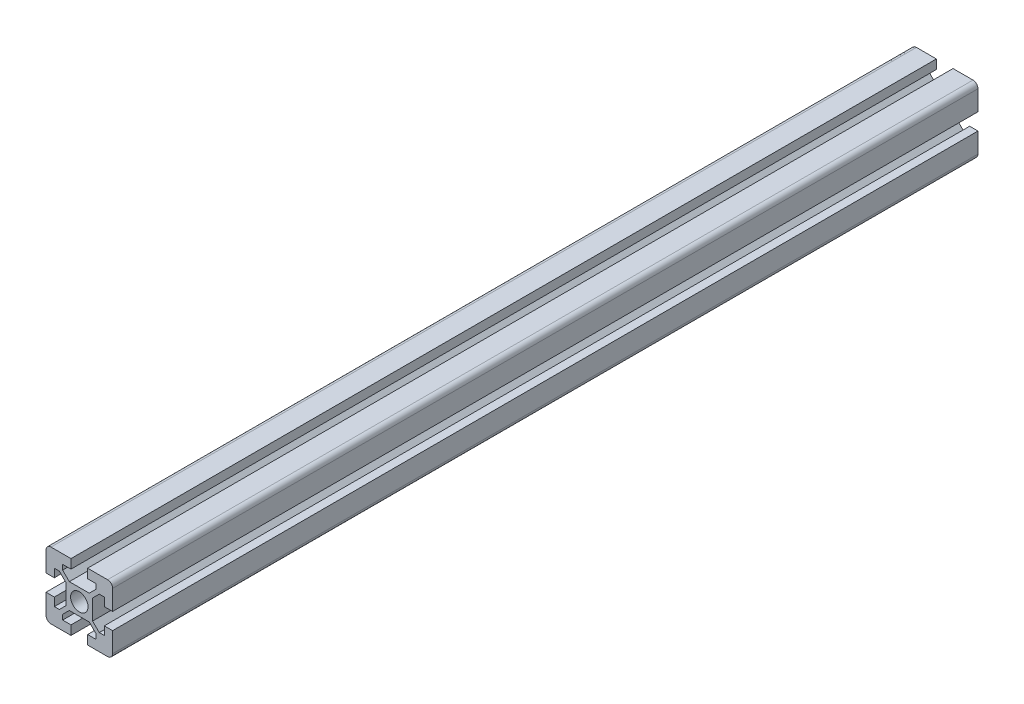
from build123d import *

# Parameters (mm, degrees)
SKETCH_1_R      = 5.25
EXTRUDE_1_DEPTH = 520


with BuildPart() as part:
    # Sketch 1 → Extrude 1 (new body)
    with BuildSketch(Plane.XY):
        with BuildLine():
            Line((10, -5.5), (15, -5.5))
            Line((15, -5.5), (15, 0))
            Line((15, 0), (3, 0))
            ThreePointArc((3, 0), (0.878679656, -0.878679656), (0, -3))
            Line((0, -3), (0, -15))
            Line((0, -15), (5, -15))
            Line((5, -15), (5, -10))
            Line((5, -10), (8, -10))
            Line((8, -10), (12, -14))
            Line((12, -14), (12, -26))
            Line((12, -26), (8, -30))
            Line((8, -30), (5, -30))
            Line((5, -30), (5, -25))
            Line((5, -25), (0, -25))
            Line((0, -25), (0, -37))
            ThreePointArc((0, -37), (0.878679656, -39.121320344), (3, -40))
            Line((3, -40), (15, -40))
            Line((15, -40), (15, -34.5))
            Line((15, -34.5), (10, -34.5))
            Line((10, -34.5), (10, -31.5))
            Line((10, -31.5), (14, -27.5))
            Line((14, -27.5), (26, -27.5))
            Line((26, -27.5), (30, -31.5))
            Line((30, -31.5), (30, -34.5))
            Line((30, -34.5), (25, -34.5))
            Line((25, -34.5), (25, -40))
            Line((25, -40), (37, -40))
            ThreePointArc((37, -40), (39.121320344, -39.121320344), (40, -37))
            Line((40, -37), (40, -25))
            Line((40, -25), (35, -25))
            Line((35, -25), (35, -30))
            Line((35, -30), (32, -30))
            Line((32, -30), (28, -26))
            Line((28, -26), (28, -14))
            Line((28, -14), (32, -10))
            Line((32, -10), (35, -10))
            Line((35, -10), (35, -15))
            Line((35, -15), (40, -15))
            Line((40, -15), (40, -3))
            ThreePointArc((40, -3), (39.121320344, -0.878679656), (37, 0))
            Line((37, 0), (25, 0))
            Line((25, 0), (25, -5.5))
            Line((25, -5.5), (30, -5.5))
            Line((30, -5.5), (30, -8.5))
            Line((30, -8.5), (26, -12.5))
            Line((26, -12.5), (14, -12.5))
            Line((14, -12.5), (10, -8.5))
            Line((10, -8.5), (10, -5.5))
        make_face()
        with Locations((20, -20)):
            Circle(SKETCH_1_R, mode=Mode.SUBTRACT)
    extrude(amount=EXTRUDE_1_DEPTH)


solid = part.part
